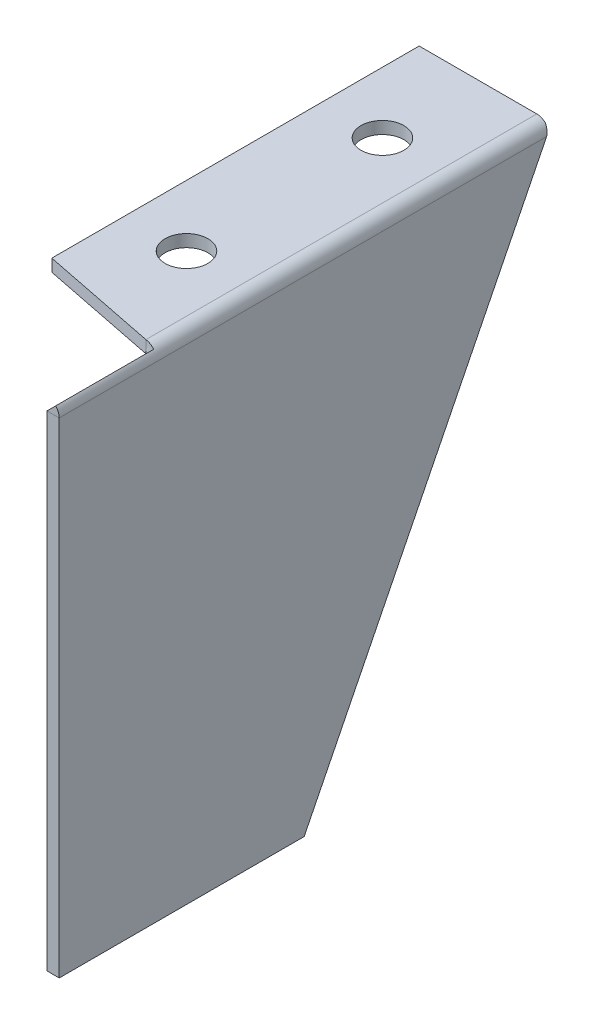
ISO-10303-21;
HEADER;
FILE_DESCRIPTION(('STEP AP214'),'2;1');
FILE_NAME('part.step','',(''),(''),'','','');
FILE_SCHEMA(('AUTOMOTIVE_DESIGN { 1 0 10303 214 1 1 1 1 }'));
ENDSEC;
DATA;
#1=APPLICATION_CONTEXT('core data for automotive mechanical design processes');
#2=APPLICATION_PROTOCOL_DEFINITION('international standard','automotive_design',2000,#1);
#3=PRODUCT_CONTEXT('',#1,'mechanical');
#4=PRODUCT('Part','Part','',(#3));
#5=PRODUCT_RELATED_PRODUCT_CATEGORY('part','',(#4));
#6=PRODUCT_DEFINITION_FORMATION('','',#4);
#7=PRODUCT_DEFINITION_CONTEXT('part definition',#1,'design');
#8=PRODUCT_DEFINITION('design','',#6,#7);
#9=PRODUCT_DEFINITION_SHAPE('','',#8);
#10=(LENGTH_UNIT() NAMED_UNIT(*) SI_UNIT(.MILLI.,.METRE.));
#11=(NAMED_UNIT(*) PLANE_ANGLE_UNIT() SI_UNIT($,.RADIAN.));
#12=(NAMED_UNIT(*) SI_UNIT($,.STERADIAN.) SOLID_ANGLE_UNIT());
#13=UNCERTAINTY_MEASURE_WITH_UNIT(LENGTH_MEASURE(1.E-05),#10,'distance_accuracy_value','');
#14=(GEOMETRIC_REPRESENTATION_CONTEXT(3) GLOBAL_UNCERTAINTY_ASSIGNED_CONTEXT((#13)) GLOBAL_UNIT_ASSIGNED_CONTEXT((#10,
#11,#12)) REPRESENTATION_CONTEXT('',''));
#15=CARTESIAN_POINT('',(0.,0.,0.));
#16=DIRECTION('',(0.,0.,1.));
#17=DIRECTION('',(1.,0.,0.));
#18=AXIS2_PLACEMENT_3D('',#15,#16,#17);
#19=CARTESIAN_POINT('',(9.60751552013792,10.3924844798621,0.));
#20=DIRECTION('',(-1.,0.,0.));
#21=DIRECTION('',(0.,0.,-1.));
#22=AXIS2_PLACEMENT_3D('',#19,#20,#21);
#23=PLANE('',#22);
#24=DIRECTION('',(0.,-1.,0.));
#25=VECTOR('',#24,1.);
#26=CARTESIAN_POINT('',(9.60751552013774,-39.6075155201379,40.));
#27=LINE('',#26,#25);
#28=CARTESIAN_POINT('',(9.60751552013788,-0.000999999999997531,40.));
#29=VERTEX_POINT('',#28);
#30=CARTESIAN_POINT('',(9.60751552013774,-39.6075155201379,40.));
#31=VERTEX_POINT('',#30);
#32=EDGE_CURVE('E83',#29,#31,#27,.T.);
#33=ORIENTED_EDGE('',*,*,#32,.F.);
#34=DIRECTION('',(0.,0.,-1.));
#35=VECTOR('',#34,1.);
#36=CARTESIAN_POINT('',(9.60751552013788,-0.000999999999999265,0.));
#37=LINE('',#36,#35);
#38=CARTESIAN_POINT('',(9.60751552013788,-0.000999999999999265,0.196742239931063));
#39=VERTEX_POINT('',#38);
#40=EDGE_CURVE('E75',#29,#39,#37,.T.);
#41=ORIENTED_EDGE('',*,*,#40,.T.);
#42=DIRECTION('',(0.,0.894427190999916,-0.447213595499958));
#43=VECTOR('',#42,1.);
#44=CARTESIAN_POINT('',(9.60751552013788,0.392484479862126,0.));
#45=LINE('',#44,#43);
#46=CARTESIAN_POINT('',(9.60751552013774,-39.6075155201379,20.));
#47=VERTEX_POINT('',#46);
#48=EDGE_CURVE('E91',#47,#39,#45,.T.);
#49=ORIENTED_EDGE('',*,*,#48,.F.);
#50=DIRECTION('',(0.,0.,-1.));
#51=VECTOR('',#50,1.);
#52=CARTESIAN_POINT('',(9.60751552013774,-39.6075155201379,20.));
#53=LINE('',#52,#51);
#54=EDGE_CURVE('E378',#31,#47,#53,.T.);
#55=ORIENTED_EDGE('',*,*,#54,.F.);
#56=EDGE_LOOP('',(#33,#41,#49,#55));
#57=FACE_BOUND('',#56,.T.);
#58=ADVANCED_FACE('F64',(#57),#23,.T.);
#59=CARTESIAN_POINT('',(10.6075155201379,10.3924844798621,0.));
#60=DIRECTION('',(-1.,0.,0.));
#61=DIRECTION('',(0.,0.,-1.));
#62=AXIS2_PLACEMENT_3D('',#59,#60,#61);
#63=PLANE('',#62);
#64=DIRECTION('',(0.,0.,-1.));
#65=VECTOR('',#64,1.);
#66=CARTESIAN_POINT('',(10.6075155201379,-0.00100000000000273,0.));
#67=LINE('',#66,#65);
#68=CARTESIAN_POINT('',(10.6075155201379,-0.001000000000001,40.));
#69=VERTEX_POINT('',#68);
#70=CARTESIAN_POINT('',(10.6075155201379,-0.00100000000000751,0.196742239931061));
#71=VERTEX_POINT('',#70);
#72=EDGE_CURVE('E384',#69,#71,#67,.T.);
#73=ORIENTED_EDGE('',*,*,#72,.F.);
#74=DIRECTION('',(0.,-1.,0.));
#75=VECTOR('',#74,1.);
#76=CARTESIAN_POINT('',(10.6075155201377,-39.6075155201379,40.));
#77=LINE('',#76,#75);
#78=CARTESIAN_POINT('',(10.6075155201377,-39.6075155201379,40.));
#79=VERTEX_POINT('',#78);
#80=EDGE_CURVE('E377',#69,#79,#77,.T.);
#81=ORIENTED_EDGE('',*,*,#80,.T.);
#82=DIRECTION('',(0.,0.,-1.));
#83=VECTOR('',#82,1.);
#84=CARTESIAN_POINT('',(10.6075155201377,-39.6075155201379,20.));
#85=LINE('',#84,#83);
#86=CARTESIAN_POINT('',(10.6075155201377,-39.6075155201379,20.));
#87=VERTEX_POINT('',#86);
#88=EDGE_CURVE('E374',#79,#87,#85,.T.);
#89=ORIENTED_EDGE('',*,*,#88,.T.);
#90=DIRECTION('',(0.,0.894427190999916,-0.447213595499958));
#91=VECTOR('',#90,1.);
#92=CARTESIAN_POINT('',(10.6075155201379,0.392484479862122,0.));
#93=LINE('',#92,#91);
#94=EDGE_CURVE('E376',#87,#71,#93,.T.);
#95=ORIENTED_EDGE('',*,*,#94,.T.);
#96=EDGE_LOOP('',(#73,#81,#89,#95));
#97=FACE_BOUND('',#96,.T.);
#98=ADVANCED_FACE('F402',(#97),#63,.F.);
#99=CARTESIAN_POINT('',(10.6075155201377,-39.6075155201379,40.));
#100=DIRECTION('',(0.,0.,-1.));
#101=DIRECTION('',(0.,1.,0.));
#102=AXIS2_PLACEMENT_3D('',#99,#100,#101);
#103=PLANE('',#102);
#104=DIRECTION('',(1.,0.,0.));
#105=VECTOR('',#104,1.);
#106=CARTESIAN_POINT('',(10.6075155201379,-0.001000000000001,40.));
#107=LINE('',#106,#105);
#108=EDGE_CURVE('E14',#29,#69,#107,.T.);
#109=ORIENTED_EDGE('',*,*,#108,.F.);
#110=ORIENTED_EDGE('',*,*,#32,.T.);
#111=DIRECTION('',(-1.,0.,0.));
#112=VECTOR('',#111,1.);
#113=CARTESIAN_POINT('',(10.6075155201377,-39.6075155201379,40.));
#114=LINE('',#113,#112);
#115=EDGE_CURVE('E382',#79,#31,#114,.T.);
#116=ORIENTED_EDGE('',*,*,#115,.F.);
#117=ORIENTED_EDGE('',*,*,#80,.F.);
#118=EDGE_LOOP('',(#109,#110,#116,#117));
#119=FACE_BOUND('',#118,.T.);
#120=ADVANCED_FACE('F66',(#119),#103,.F.);
#121=CARTESIAN_POINT('',(10.6075155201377,-39.6075155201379,20.));
#122=DIRECTION('',(0.,1.,0.));
#123=DIRECTION('',(0.,0.,1.));
#124=AXIS2_PLACEMENT_3D('',#121,#122,#123);
#125=PLANE('',#124);
#126=ORIENTED_EDGE('',*,*,#54,.T.);
#127=DIRECTION('',(-1.,0.,0.));
#128=VECTOR('',#127,1.);
#129=CARTESIAN_POINT('',(10.6075155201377,-39.6075155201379,20.));
#130=LINE('',#129,#128);
#131=EDGE_CURVE('E380',#87,#47,#130,.T.);
#132=ORIENTED_EDGE('',*,*,#131,.F.);
#133=ORIENTED_EDGE('',*,*,#88,.F.);
#134=ORIENTED_EDGE('',*,*,#115,.T.);
#135=EDGE_LOOP('',(#126,#132,#133,#134));
#136=FACE_BOUND('',#135,.T.);
#137=ADVANCED_FACE('F350',(#136),#125,.F.);
#138=CARTESIAN_POINT('',(10.6075155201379,0.392484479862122,0.));
#139=DIRECTION('',(0.,0.447213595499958,0.894427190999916));
#140=DIRECTION('',(0.,-0.894427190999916,0.447213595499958));
#141=AXIS2_PLACEMENT_3D('',#138,#139,#140);
#142=PLANE('',#141);
#143=CARTESIAN_POINT('',(10.6075155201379,-0.00100000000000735,0.196742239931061));
#144=CARTESIAN_POINT('',(9.60751552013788,-0.000999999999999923,0.196742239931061));
#145=B_SPLINE_CURVE_WITH_KNOTS('',1,(#143,#144),.UNSPECIFIED.,.F.,.F.,(2,2),(0.,1.),.UNSPECIFIED.);
#146=EDGE_CURVE('E287',#71,#39,#145,.T.);
#147=ORIENTED_EDGE('',*,*,#146,.F.);
#148=ORIENTED_EDGE('',*,*,#94,.F.);
#149=ORIENTED_EDGE('',*,*,#131,.T.);
#150=ORIENTED_EDGE('',*,*,#48,.T.);
#151=EDGE_LOOP('',(#147,#148,#149,#150));
#152=FACE_BOUND('',#151,.T.);
#153=ADVANCED_FACE('F324',(#152),#142,.F.);
#154=CARTESIAN_POINT('',(0.,1.,30.));
#155=DIRECTION('',(1.,0.,0.));
#156=DIRECTION('',(0.,0.,-1.));
#157=AXIS2_PLACEMENT_3D('',#154,#155,#156);
#158=PLANE('',#157);
#159=DIRECTION('',(0.,0.,1.));
#160=VECTOR('',#159,1.);
#161=CARTESIAN_POINT('',(0.,0.,30.));
#162=LINE('',#161,#160);
#163=CARTESIAN_POINT('',(0.,0.,0.));
#164=VERTEX_POINT('',#163);
#165=CARTESIAN_POINT('',(0.,0.,30.));
#166=VERTEX_POINT('',#165);
#167=EDGE_CURVE('E371',#164,#166,#162,.T.);
#168=ORIENTED_EDGE('',*,*,#167,.T.);
#169=DIRECTION('',(0.,-1.,0.));
#170=VECTOR('',#169,1.);
#171=CARTESIAN_POINT('',(0.,1.,30.));
#172=LINE('',#171,#170);
#173=CARTESIAN_POINT('',(0.,1.,30.));
#174=VERTEX_POINT('',#173);
#175=EDGE_CURVE('E310',#174,#166,#172,.T.);
#176=ORIENTED_EDGE('',*,*,#175,.F.);
#177=DIRECTION('',(0.,0.,1.));
#178=VECTOR('',#177,1.);
#179=CARTESIAN_POINT('',(0.,1.,30.));
#180=LINE('',#179,#178);
#181=CARTESIAN_POINT('',(0.,1.,0.));
#182=VERTEX_POINT('',#181);
#183=EDGE_CURVE('E453',#182,#174,#180,.T.);
#184=ORIENTED_EDGE('',*,*,#183,.F.);
#185=DIRECTION('',(0.,-1.,0.));
#186=VECTOR('',#185,1.);
#187=CARTESIAN_POINT('',(0.,1.,0.));
#188=LINE('',#187,#186);
#189=EDGE_CURVE('E463',#182,#164,#188,.T.);
#190=ORIENTED_EDGE('',*,*,#189,.T.);
#191=EDGE_LOOP('',(#168,#176,#184,#190));
#192=FACE_BOUND('',#191,.T.);
#193=ADVANCED_FACE('F320',(#192),#158,.F.);
#194=CARTESIAN_POINT('',(5.,1.,8.));
#195=DIRECTION('',(0.,-1.,0.));
#196=DIRECTION('',(0.,0.,-1.));
#197=AXIS2_PLACEMENT_3D('',#194,#195,#196);
#198=CYLINDRICAL_SURFACE('',#197,1.75);
#199=CARTESIAN_POINT('',(5.,1.,8.));
#200=DIRECTION('',(0.,1.,0.));
#201=DIRECTION('',(0.,0.,1.));
#202=AXIS2_PLACEMENT_3D('',#199,#200,#201);
#203=CIRCLE('',#202,1.75);
#204=CARTESIAN_POINT('',(5.,1.,9.75));
#205=VERTEX_POINT('',#204);
#206=EDGE_CURVE('E466',#205,#205,#203,.T.);
#207=ORIENTED_EDGE('',*,*,#206,.T.);
#208=EDGE_LOOP('',(#207));
#209=FACE_BOUND('',#208,.T.);
#210=CARTESIAN_POINT('',(5.,0.,8.));
#211=DIRECTION('',(0.,1.,0.));
#212=DIRECTION('',(0.,0.,1.));
#213=AXIS2_PLACEMENT_3D('',#210,#211,#212);
#214=CIRCLE('',#213,1.75);
#215=CARTESIAN_POINT('',(5.,0.,9.75));
#216=VERTEX_POINT('',#215);
#217=EDGE_CURVE('E485',#216,#216,#214,.T.);
#218=ORIENTED_EDGE('',*,*,#217,.F.);
#219=EDGE_LOOP('',(#218));
#220=FACE_BOUND('',#219,.T.);
#221=ADVANCED_FACE('F323',(#209,#220),#198,.F.);
#222=CARTESIAN_POINT('',(5.,1.,24.));
#223=DIRECTION('',(0.,-1.,0.));
#224=DIRECTION('',(0.,0.,-1.));
#225=AXIS2_PLACEMENT_3D('',#222,#223,#224);
#226=CYLINDRICAL_SURFACE('',#225,1.75);
#227=CARTESIAN_POINT('',(5.,1.,24.));
#228=DIRECTION('',(0.,1.,0.));
#229=DIRECTION('',(0.,0.,1.));
#230=AXIS2_PLACEMENT_3D('',#227,#228,#229);
#231=CIRCLE('',#230,1.75);
#232=CARTESIAN_POINT('',(5.,1.,25.75));
#233=VERTEX_POINT('',#232);
#234=EDGE_CURVE('E456',#233,#233,#231,.T.);
#235=ORIENTED_EDGE('',*,*,#234,.T.);
#236=EDGE_LOOP('',(#235));
#237=FACE_BOUND('',#236,.T.);
#238=CARTESIAN_POINT('',(5.,0.,24.));
#239=DIRECTION('',(0.,1.,0.));
#240=DIRECTION('',(0.,0.,1.));
#241=AXIS2_PLACEMENT_3D('',#238,#239,#240);
#242=CIRCLE('',#241,1.75);
#243=CARTESIAN_POINT('',(5.,0.,25.75));
#244=VERTEX_POINT('',#243);
#245=EDGE_CURVE('E367',#244,#244,#242,.T.);
#246=ORIENTED_EDGE('',*,*,#245,.F.);
#247=EDGE_LOOP('',(#246));
#248=FACE_BOUND('',#247,.T.);
#249=ADVANCED_FACE('F328',(#237,#248),#226,.F.);
#250=CARTESIAN_POINT('',(0.,1.,0.));
#251=DIRECTION('',(0.,-1.,0.));
#252=DIRECTION('',(0.,0.,-1.));
#253=AXIS2_PLACEMENT_3D('',#250,#251,#252);
#254=PLANE('',#253);
#255=ORIENTED_EDGE('',*,*,#234,.F.);
#256=EDGE_LOOP('',(#255));
#257=FACE_BOUND('',#256,.T.);
#258=ORIENTED_EDGE('',*,*,#206,.F.);
#259=EDGE_LOOP('',(#258));
#260=FACE_BOUND('',#259,.T.);
#261=DIRECTION('',(0.98058067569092,0.,0.196116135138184));
#262=VECTOR('',#261,1.);
#263=CARTESIAN_POINT('',(10.,1.,32.));
#264=LINE('',#263,#262);
#265=CARTESIAN_POINT('',(9.60651552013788,1.,31.9213031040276));
#266=VERTEX_POINT('',#265);
#267=EDGE_CURVE('E449',#174,#266,#264,.T.);
#268=ORIENTED_EDGE('',*,*,#267,.T.);
#269=DIRECTION('',(0.,0.,-1.));
#270=VECTOR('',#269,1.);
#271=CARTESIAN_POINT('',(9.60651552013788,1.,0.));
#272=LINE('',#271,#270);
#273=CARTESIAN_POINT('',(9.60651552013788,1.,0.));
#274=VERTEX_POINT('',#273);
#275=EDGE_CURVE('E450',#266,#274,#272,.T.);
#276=ORIENTED_EDGE('',*,*,#275,.T.);
#277=DIRECTION('',(-1.,0.,0.));
#278=VECTOR('',#277,1.);
#279=CARTESIAN_POINT('',(0.,1.,0.));
#280=LINE('',#279,#278);
#281=EDGE_CURVE('E471',#274,#182,#280,.T.);
#282=ORIENTED_EDGE('',*,*,#281,.T.);
#283=ORIENTED_EDGE('',*,*,#183,.T.);
#284=EDGE_LOOP('',(#268,#276,#282,#283));
#285=FACE_BOUND('',#284,.T.);
#286=ADVANCED_FACE('F332',(#257,#260,#285),#254,.F.);
#287=CARTESIAN_POINT('',(0.,1.,0.));
#288=DIRECTION('',(0.,0.,1.));
#289=DIRECTION('',(1.,0.,0.));
#290=AXIS2_PLACEMENT_3D('',#287,#288,#289);
#291=PLANE('',#290);
#292=ORIENTED_EDGE('',*,*,#281,.F.);
#293=DIRECTION('',(0.,-1.,0.));
#294=VECTOR('',#293,1.);
#295=CARTESIAN_POINT('',(9.60651552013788,1.,0.));
#296=LINE('',#295,#294);
#297=CARTESIAN_POINT('',(9.60651552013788,0.,0.));
#298=VERTEX_POINT('',#297);
#299=EDGE_CURVE('E412',#274,#298,#296,.T.);
#300=ORIENTED_EDGE('',*,*,#299,.T.);
#301=DIRECTION('',(-1.,0.,0.));
#302=VECTOR('',#301,1.);
#303=CARTESIAN_POINT('',(0.,0.,0.));
#304=LINE('',#303,#302);
#305=EDGE_CURVE('E487',#298,#164,#304,.T.);
#306=ORIENTED_EDGE('',*,*,#305,.T.);
#307=ORIENTED_EDGE('',*,*,#189,.F.);
#308=EDGE_LOOP('',(#292,#300,#306,#307));
#309=FACE_BOUND('',#308,.T.);
#310=ADVANCED_FACE('F336',(#309),#291,.F.);
#311=CARTESIAN_POINT('',(0.,0.,0.));
#312=DIRECTION('',(0.,-1.,0.));
#313=DIRECTION('',(0.,0.,-1.));
#314=AXIS2_PLACEMENT_3D('',#311,#312,#313);
#315=PLANE('',#314);
#316=DIRECTION('',(0.,0.,-1.));
#317=VECTOR('',#316,1.);
#318=CARTESIAN_POINT('',(9.60651552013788,0.,0.));
#319=LINE('',#318,#317);
#320=CARTESIAN_POINT('',(9.60651552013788,0.,31.9213031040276));
#321=VERTEX_POINT('',#320);
#322=EDGE_CURVE('E162',#321,#298,#319,.T.);
#323=ORIENTED_EDGE('',*,*,#322,.F.);
#324=DIRECTION('',(0.98058067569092,0.,0.196116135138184));
#325=VECTOR('',#324,1.);
#326=CARTESIAN_POINT('',(10.,0.,32.));
#327=LINE('',#326,#325);
#328=EDGE_CURVE('E359',#166,#321,#327,.T.);
#329=ORIENTED_EDGE('',*,*,#328,.F.);
#330=ORIENTED_EDGE('',*,*,#167,.F.);
#331=ORIENTED_EDGE('',*,*,#305,.F.);
#332=EDGE_LOOP('',(#323,#329,#330,#331));
#333=FACE_BOUND('',#332,.T.);
#334=ORIENTED_EDGE('',*,*,#217,.T.);
#335=EDGE_LOOP('',(#334));
#336=FACE_BOUND('',#335,.T.);
#337=ORIENTED_EDGE('',*,*,#245,.T.);
#338=EDGE_LOOP('',(#337));
#339=FACE_BOUND('',#338,.T.);
#340=ADVANCED_FACE('F340',(#333,#336,#339),#315,.T.);
#341=CARTESIAN_POINT('',(10.,1.,32.));
#342=DIRECTION('',(0.196116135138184,0.,-0.98058067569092));
#343=DIRECTION('',(-0.98058067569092,0.,-0.196116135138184));
#344=AXIS2_PLACEMENT_3D('',#341,#342,#343);
#345=PLANE('',#344);
#346=ORIENTED_EDGE('',*,*,#328,.T.);
#347=CARTESIAN_POINT('',(9.60651552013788,1.,31.9213031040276));
#348=CARTESIAN_POINT('',(9.60651552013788,0.,31.9213031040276));
#349=B_SPLINE_CURVE_WITH_KNOTS('',1,(#347,#348),.UNSPECIFIED.,.F.,.F.,(2,2),(0.,1.),.UNSPECIFIED.);
#350=EDGE_CURVE('E366',#321,#266,#349,.F.);
#351=ORIENTED_EDGE('',*,*,#350,.T.);
#352=ORIENTED_EDGE('',*,*,#267,.F.);
#353=ORIENTED_EDGE('',*,*,#175,.T.);
#354=EDGE_LOOP('',(#346,#351,#352,#353));
#355=FACE_BOUND('',#354,.T.);
#356=ADVANCED_FACE('F344',(#355),#345,.F.);
#357=CARTESIAN_POINT('',(9.60651552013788,-0.000999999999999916,40.));
#358=DIRECTION('',(0.,0.,1.));
#359=DIRECTION('',(1.,0.,0.));
#360=AXIS2_PLACEMENT_3D('',#357,#358,#359);
#361=PLANE('',#360);
#362=DIRECTION('',(0.707106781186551,0.707106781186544,0.));
#363=VECTOR('',#362,1.);
#364=CARTESIAN_POINT('',(10.3143294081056,0.706813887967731,40.));
#365=LINE('',#364,#363);
#366=CARTESIAN_POINT('',(9.60722262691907,-0.000292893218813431,40.));
#367=VERTEX_POINT('',#366);
#368=CARTESIAN_POINT('',(10.3143294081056,0.706813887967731,40.));
#369=VERTEX_POINT('',#368);
#370=EDGE_CURVE('E152',#367,#369,#365,.T.);
#371=ORIENTED_EDGE('',*,*,#370,.F.);
#372=CARTESIAN_POINT('',(9.60651552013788,-0.000999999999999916,40.));
#373=DIRECTION('',(0.,0.,-1.));
#374=DIRECTION('',(-1.,0.,0.));
#375=AXIS2_PLACEMENT_3D('',#372,#373,#374);
#376=CIRCLE('',#375,0.000999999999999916);
#377=EDGE_CURVE('E492',#367,#29,#376,.T.);
#378=ORIENTED_EDGE('',*,*,#377,.T.);
#379=ORIENTED_EDGE('',*,*,#108,.T.);
#380=CARTESIAN_POINT('',(9.60651552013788,-0.000999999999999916,40.));
#381=DIRECTION('',(0.,0.,-1.));
#382=DIRECTION('',(-1.,0.,0.));
#383=AXIS2_PLACEMENT_3D('',#380,#381,#382);
#384=CIRCLE('',#383,1.001);
#385=EDGE_CURVE('E166',#369,#69,#384,.T.);
#386=ORIENTED_EDGE('',*,*,#385,.F.);
#387=EDGE_LOOP('',(#371,#378,#379,#386));
#388=FACE_BOUND('',#387,.T.);
#389=ADVANCED_FACE('F167',(#388),#361,.T.);
#390=CARTESIAN_POINT('',(10.6075155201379,-0.00100000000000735,0.196742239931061));
#391=CARTESIAN_POINT('',(10.6075155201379,0.130052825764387,0.163946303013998));
#392=CARTESIAN_POINT('',(10.5814621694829,0.261009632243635,0.131161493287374));
#393=CARTESIAN_POINT('',(10.4811756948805,0.503122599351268,0.065580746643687));
#394=CARTESIAN_POINT('',(10.4069977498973,0.614145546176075,0.0327959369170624));
#395=CARTESIAN_POINT('',(10.3143294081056,0.706813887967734,0.));
#396=CARTESIAN_POINT('',(9.60751552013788,-0.000999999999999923,0.196742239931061));
#397=CARTESIAN_POINT('',(9.60751552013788,-0.000869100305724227,0.163951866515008));
#398=CARTESIAN_POINT('',(9.60748949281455,-0.000738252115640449,0.131161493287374));
#399=CARTESIAN_POINT('',(9.60738930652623,-0.00049638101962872,0.065580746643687));
#400=CARTESIAN_POINT('',(9.60731518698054,-0.000385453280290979,0.0327903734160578));
#401=CARTESIAN_POINT('',(9.60722262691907,-0.000292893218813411,0.));
#402=B_SPLINE_SURFACE_WITH_KNOTS('',1,3,((#390,#391,#392,#393,#394,#395),(#396,#397,#398,#399,
#400,#401)),.UNSPECIFIED.,.F.,.F.,.F.,(2,2),(4,2,4),(0.,1.),(0.,0.5,1.),.UNSPECIFIED.);
#403=CARTESIAN_POINT('',(9.60751552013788,-0.000999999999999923,0.196742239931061));
#404=CARTESIAN_POINT('',(9.60751552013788,-0.000869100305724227,0.163951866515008));
#405=CARTESIAN_POINT('',(9.60748949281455,-0.000738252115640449,0.131161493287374));
#406=CARTESIAN_POINT('',(9.60738930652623,-0.00049638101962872,0.065580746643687));
#407=CARTESIAN_POINT('',(9.60731518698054,-0.000385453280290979,0.0327903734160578));
#408=CARTESIAN_POINT('',(9.60722262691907,-0.000292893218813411,0.));
#409=B_SPLINE_CURVE_WITH_KNOTS('',3,(#403,#404,#405,#406,#407,#408),.UNSPECIFIED.,.F.,.F.,(4,2,
4),(0.,0.5,1.),.UNSPECIFIED.);
#410=CARTESIAN_POINT('',(9.60722262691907,-0.000292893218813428,0.));
#411=VERTEX_POINT('',#410);
#412=EDGE_CURVE('E427',#39,#411,#409,.T.);
#413=CARTESIAN_POINT('',(9.60722262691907,-0.000292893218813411,0.));
#414=CARTESIAN_POINT('',(10.3143294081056,0.706813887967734,0.));
#415=B_SPLINE_CURVE_WITH_KNOTS('',1,(#413,#414),.UNSPECIFIED.,.F.,.F.,(2,2),(0.,1.),.UNSPECIFIED.);
#416=CARTESIAN_POINT('',(10.3143294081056,0.706813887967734,0.));
#417=VERTEX_POINT('',#416);
#418=EDGE_CURVE('E163',#411,#417,#415,.T.);
#419=CARTESIAN_POINT('',(10.3143294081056,0.706813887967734,0.));
#420=CARTESIAN_POINT('',(10.4069977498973,0.614145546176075,0.0327959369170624));
#421=CARTESIAN_POINT('',(10.4811756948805,0.503122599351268,0.065580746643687));
#422=CARTESIAN_POINT('',(10.5814621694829,0.261009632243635,0.131161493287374));
#423=CARTESIAN_POINT('',(10.6075155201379,0.130052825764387,0.163946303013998));
#424=CARTESIAN_POINT('',(10.6075155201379,-0.00100000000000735,0.196742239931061));
#425=B_SPLINE_CURVE_WITH_KNOTS('',3,(#419,#420,#421,#422,#423,#424),.UNSPECIFIED.,.F.,.F.,(4,2,
4),(0.,0.5,1.),.UNSPECIFIED.);
#426=EDGE_CURVE('E170',#71,#417,#425,.F.);
#427=ORIENTED_EDGE('',*,*,#146,.T.);
#428=ORIENTED_EDGE('',*,*,#412,.T.);
#429=ORIENTED_EDGE('',*,*,#418,.T.);
#430=ORIENTED_EDGE('',*,*,#426,.F.);
#431=EDGE_LOOP('',(#427,#428,#429,#430));
#432=FACE_BOUND('',#431,.T.);
#433=ADVANCED_FACE('F238',(#432),#402,.T.);
#434=CARTESIAN_POINT('',(9.60651552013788,-0.000999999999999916,0.));
#435=DIRECTION('',(0.,0.,-1.));
#436=DIRECTION('',(-1.,0.,0.));
#437=AXIS2_PLACEMENT_3D('',#434,#435,#436);
#438=PLANE('',#437);
#439=ORIENTED_EDGE('',*,*,#418,.F.);
#440=CARTESIAN_POINT('',(9.60651552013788,-0.000999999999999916,0.));
#441=DIRECTION('',(0.,0.,-1.));
#442=DIRECTION('',(-1.,0.,0.));
#443=AXIS2_PLACEMENT_3D('',#440,#441,#442);
#444=CIRCLE('',#443,0.000999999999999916);
#445=EDGE_CURVE('E425',#411,#298,#444,.F.);
#446=ORIENTED_EDGE('',*,*,#445,.T.);
#447=ORIENTED_EDGE('',*,*,#299,.F.);
#448=CARTESIAN_POINT('',(9.60651552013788,-0.000999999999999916,0.));
#449=DIRECTION('',(0.,0.,1.));
#450=DIRECTION('',(1.,0.,0.));
#451=AXIS2_PLACEMENT_3D('',#448,#449,#450);
#452=CIRCLE('',#451,1.001);
#453=EDGE_CURVE('E180',#417,#274,#452,.T.);
#454=ORIENTED_EDGE('',*,*,#453,.F.);
#455=EDGE_LOOP('',(#439,#446,#447,#454));
#456=FACE_BOUND('',#455,.T.);
#457=ADVANCED_FACE('F249',(#456),#438,.T.);
#458=CARTESIAN_POINT('',(9.60651552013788,1.,31.9213031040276));
#459=CARTESIAN_POINT('',(9.7375695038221,1.,31.9344215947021));
#460=CARTESIAN_POINT('',(9.86852515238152,0.973946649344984,31.9475354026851));
#461=CARTESIAN_POINT('',(10.1106381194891,0.873660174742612,31.9737677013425));
#462=CARTESIAN_POINT('',(10.221660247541,0.799483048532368,31.9868815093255));
#463=CARTESIAN_POINT('',(10.3143294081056,0.706813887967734,32.));
#464=CARTESIAN_POINT('',(9.60651552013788,0.,31.9213031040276));
#465=CARTESIAN_POINT('',(9.60664641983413,0.,31.9344192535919));
#466=CARTESIAN_POINT('',(9.60677726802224,-2.60273233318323E-05,31.9475354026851));
#467=CARTESIAN_POINT('',(9.60701913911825,-0.000126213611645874,31.9737677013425));
#468=CARTESIAN_POINT('',(9.60713006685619,-0.000200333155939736,31.9868838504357));
#469=CARTESIAN_POINT('',(9.60722262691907,-0.000292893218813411,32.));
#470=B_SPLINE_SURFACE_WITH_KNOTS('',1,3,((#458,#459,#460,#461,#462,#463),(#464,#465,#466,#467,
#468,#469)),.UNSPECIFIED.,.F.,.F.,.F.,(2,2),(4,2,4),(0.,1.),(0.,0.5,1.),.UNSPECIFIED.);
#471=CARTESIAN_POINT('',(9.60651552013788,0.,31.9213031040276));
#472=CARTESIAN_POINT('',(9.60664641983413,0.,31.9344192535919));
#473=CARTESIAN_POINT('',(9.60677726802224,-2.60273233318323E-05,31.9475354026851));
#474=CARTESIAN_POINT('',(9.60701913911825,-0.000126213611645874,31.9737677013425));
#475=CARTESIAN_POINT('',(9.60713006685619,-0.000200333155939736,31.9868838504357));
#476=CARTESIAN_POINT('',(9.60722262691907,-0.000292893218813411,32.));
#477=B_SPLINE_CURVE_WITH_KNOTS('',3,(#471,#472,#473,#474,#475,#476),.UNSPECIFIED.,.F.,.F.,(4,2,
4),(0.,0.5,1.),.UNSPECIFIED.);
#478=CARTESIAN_POINT('',(9.60722262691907,-0.000292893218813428,32.));
#479=VERTEX_POINT('',#478);
#480=EDGE_CURVE('E191',#321,#479,#477,.T.);
#481=CARTESIAN_POINT('',(9.60722262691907,-0.000292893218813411,32.));
#482=CARTESIAN_POINT('',(10.3143294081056,0.706813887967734,32.));
#483=B_SPLINE_CURVE_WITH_KNOTS('',1,(#481,#482),.UNSPECIFIED.,.F.,.F.,(2,2),(0.,1.),.UNSPECIFIED.);
#484=CARTESIAN_POINT('',(10.3143294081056,0.706813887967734,32.));
#485=VERTEX_POINT('',#484);
#486=EDGE_CURVE('E177',#479,#485,#483,.T.);
#487=CARTESIAN_POINT('',(10.3143294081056,0.706813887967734,32.));
#488=CARTESIAN_POINT('',(10.221660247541,0.799483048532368,31.9868815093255));
#489=CARTESIAN_POINT('',(10.1106381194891,0.873660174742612,31.9737677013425));
#490=CARTESIAN_POINT('',(9.86852515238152,0.973946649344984,31.9475354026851));
#491=CARTESIAN_POINT('',(9.7375695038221,1.,31.9344215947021));
#492=CARTESIAN_POINT('',(9.60651552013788,1.,31.9213031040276));
#493=B_SPLINE_CURVE_WITH_KNOTS('',3,(#487,#488,#489,#490,#491,#492),.UNSPECIFIED.,.F.,.F.,(4,2,
4),(0.,0.5,1.),.UNSPECIFIED.);
#494=EDGE_CURVE('E175',#266,#485,#493,.F.);
#495=ORIENTED_EDGE('',*,*,#350,.F.);
#496=ORIENTED_EDGE('',*,*,#480,.T.);
#497=ORIENTED_EDGE('',*,*,#486,.T.);
#498=ORIENTED_EDGE('',*,*,#494,.F.);
#499=EDGE_LOOP('',(#495,#496,#497,#498));
#500=FACE_BOUND('',#499,.T.);
#501=ADVANCED_FACE('F209',(#500),#470,.T.);
#502=CARTESIAN_POINT('',(10.3143294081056,0.706813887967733,36.));
#503=DIRECTION('',(-0.707106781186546,0.707106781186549,0.));
#504=DIRECTION('',(0.,0.,1.));
#505=AXIS2_PLACEMENT_3D('',#502,#503,#504);
#506=PLANE('',#505);
#507=DIRECTION('',(0.,0.,-1.));
#508=VECTOR('',#507,1.);
#509=CARTESIAN_POINT('',(9.60722262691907,-0.000292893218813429,55.9808879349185));
#510=LINE('',#509,#508);
#511=EDGE_CURVE('E158',#479,#367,#510,.F.);
#512=ORIENTED_EDGE('',*,*,#511,.T.);
#513=ORIENTED_EDGE('',*,*,#370,.T.);
#514=DIRECTION('',(0.,0.,1.));
#515=VECTOR('',#514,1.);
#516=CARTESIAN_POINT('',(10.3143294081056,0.706813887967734,32.));
#517=LINE('',#516,#515);
#518=EDGE_CURVE('E156',#485,#369,#517,.T.);
#519=ORIENTED_EDGE('',*,*,#518,.F.);
#520=ORIENTED_EDGE('',*,*,#486,.F.);
#521=EDGE_LOOP('',(#512,#513,#519,#520));
#522=FACE_BOUND('',#521,.T.);
#523=ADVANCED_FACE('F154',(#522),#506,.T.);
#524=CARTESIAN_POINT('',(9.60651552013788,-0.000999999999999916,55.9808879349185));
#525=DIRECTION('',(0.,0.,-1.));
#526=DIRECTION('',(-1.,0.,0.));
#527=AXIS2_PLACEMENT_3D('',#524,#525,#526);
#528=CYLINDRICAL_SURFACE('',#527,1.001);
#529=ORIENTED_EDGE('',*,*,#494,.T.);
#530=ORIENTED_EDGE('',*,*,#518,.T.);
#531=ORIENTED_EDGE('',*,*,#385,.T.);
#532=ORIENTED_EDGE('',*,*,#72,.T.);
#533=ORIENTED_EDGE('',*,*,#426,.T.);
#534=ORIENTED_EDGE('',*,*,#453,.T.);
#535=ORIENTED_EDGE('',*,*,#275,.F.);
#536=EDGE_LOOP('',(#529,#530,#531,#532,#533,#534,#535));
#537=FACE_BOUND('',#536,.T.);
#538=ADVANCED_FACE('F173',(#537),#528,.T.);
#539=CARTESIAN_POINT('',(9.60651552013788,-0.000999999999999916,55.9808879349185));
#540=DIRECTION('',(0.,0.,-1.));
#541=DIRECTION('',(-1.,0.,0.));
#542=AXIS2_PLACEMENT_3D('',#539,#540,#541);
#543=CYLINDRICAL_SURFACE('',#542,0.000999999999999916);
#544=ORIENTED_EDGE('',*,*,#480,.F.);
#545=ORIENTED_EDGE('',*,*,#322,.T.);
#546=ORIENTED_EDGE('',*,*,#445,.F.);
#547=ORIENTED_EDGE('',*,*,#412,.F.);
#548=ORIENTED_EDGE('',*,*,#40,.F.);
#549=ORIENTED_EDGE('',*,*,#377,.F.);
#550=ORIENTED_EDGE('',*,*,#511,.F.);
#551=EDGE_LOOP('',(#544,#545,#546,#547,#548,#549,#550));
#552=FACE_BOUND('',#551,.T.);
#553=ADVANCED_FACE('F198',(#552),#543,.F.);
#554=CLOSED_SHELL('',(#58,#98,#120,#137,#153,#193,#221,#249,#286,#310,#340,#356,#389,#433,#457,
#501,#523,#538,#553));
#555=MANIFOLD_SOLID_BREP('B2',#554);
#556=ADVANCED_BREP_SHAPE_REPRESENTATION('',(#18,#555),#14);
#557=SHAPE_DEFINITION_REPRESENTATION(#9,#556);
ENDSEC;
END-ISO-10303-21;
